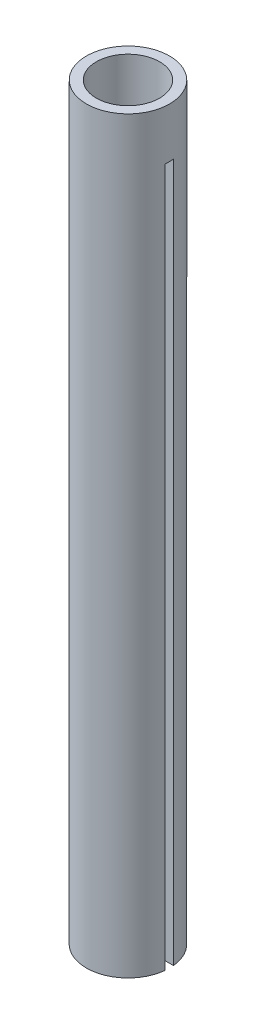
ISO-10303-21;
HEADER;
FILE_DESCRIPTION(('STEP AP214'),'2;1');
FILE_NAME('part.step','',(''),(''),'','','');
FILE_SCHEMA(('AUTOMOTIVE_DESIGN { 1 0 10303 214 1 1 1 1 }'));
ENDSEC;
DATA;
#1=APPLICATION_CONTEXT('core data for automotive mechanical design processes');
#2=APPLICATION_PROTOCOL_DEFINITION('international standard','automotive_design',2000,#1);
#3=PRODUCT_CONTEXT('',#1,'mechanical');
#4=PRODUCT('Part','Part','',(#3));
#5=PRODUCT_RELATED_PRODUCT_CATEGORY('part','',(#4));
#6=PRODUCT_DEFINITION_FORMATION('','',#4);
#7=PRODUCT_DEFINITION_CONTEXT('part definition',#1,'design');
#8=PRODUCT_DEFINITION('design','',#6,#7);
#9=PRODUCT_DEFINITION_SHAPE('','',#8);
#10=(LENGTH_UNIT() NAMED_UNIT(*) SI_UNIT(.MILLI.,.METRE.));
#11=(NAMED_UNIT(*) PLANE_ANGLE_UNIT() SI_UNIT($,.RADIAN.));
#12=(NAMED_UNIT(*) SI_UNIT($,.STERADIAN.) SOLID_ANGLE_UNIT());
#13=UNCERTAINTY_MEASURE_WITH_UNIT(LENGTH_MEASURE(1.E-05),#10,'distance_accuracy_value','');
#14=(GEOMETRIC_REPRESENTATION_CONTEXT(3) GLOBAL_UNCERTAINTY_ASSIGNED_CONTEXT((#13)) GLOBAL_UNIT_ASSIGNED_CONTEXT((#10,
#11,#12)) REPRESENTATION_CONTEXT('',''));
#15=CARTESIAN_POINT('',(0.,0.,0.));
#16=DIRECTION('',(0.,0.,1.));
#17=DIRECTION('',(1.,0.,0.));
#18=AXIS2_PLACEMENT_3D('',#15,#16,#17);
#19=CARTESIAN_POINT('',(0.,-225.,0.));
#20=DIRECTION('',(0.,1.,0.));
#21=DIRECTION('',(0.,0.,1.));
#22=AXIS2_PLACEMENT_3D('',#19,#20,#21);
#23=CYLINDRICAL_SURFACE('',#22,12.5);
#24=CARTESIAN_POINT('',(0.,0.,0.));
#25=DIRECTION('',(0.,1.,0.));
#26=DIRECTION('',(0.,0.,1.));
#27=AXIS2_PLACEMENT_3D('',#24,#25,#26);
#28=CIRCLE('',#27,12.5);
#29=CARTESIAN_POINT('',(0.,0.,12.5));
#30=VERTEX_POINT('',#29);
#31=EDGE_CURVE('E94',#30,#30,#28,.T.);
#32=ORIENTED_EDGE('',*,*,#31,.F.);
#33=EDGE_LOOP('',(#32));
#34=FACE_BOUND('',#33,.T.);
#35=CARTESIAN_POINT('',(0.,-225.,0.));
#36=DIRECTION('',(0.,1.,0.));
#37=DIRECTION('',(0.,0.,1.));
#38=AXIS2_PLACEMENT_3D('',#35,#36,#37);
#39=CIRCLE('',#38,12.5);
#40=CARTESIAN_POINT('',(12.4373429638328,-225.,-1.24999999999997));
#41=VERTEX_POINT('',#40);
#42=CARTESIAN_POINT('',(12.4373429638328,-225.,1.24999999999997));
#43=VERTEX_POINT('',#42);
#44=EDGE_CURVE('E85',#41,#43,#39,.T.);
#45=ORIENTED_EDGE('',*,*,#44,.T.);
#46=DIRECTION('',(0.,1.,0.));
#47=VECTOR('',#46,1.);
#48=CARTESIAN_POINT('',(12.4373429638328,-225.,1.24999999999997));
#49=LINE('',#48,#47);
#50=CARTESIAN_POINT('',(12.4373429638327,-15.,1.25));
#51=VERTEX_POINT('',#50);
#52=EDGE_CURVE('E80',#43,#51,#49,.T.);
#53=ORIENTED_EDGE('',*,*,#52,.T.);
#54=CARTESIAN_POINT('',(0.,-15.,0.));
#55=DIRECTION('',(0.,-1.,0.));
#56=DIRECTION('',(0.,0.,-1.));
#57=AXIS2_PLACEMENT_3D('',#54,#55,#56);
#58=CIRCLE('',#57,12.5);
#59=CARTESIAN_POINT('',(12.4373429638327,-15.,-1.25));
#60=VERTEX_POINT('',#59);
#61=EDGE_CURVE('E69',#51,#60,#58,.F.);
#62=ORIENTED_EDGE('',*,*,#61,.T.);
#63=DIRECTION('',(0.,1.,0.));
#64=VECTOR('',#63,1.);
#65=CARTESIAN_POINT('',(12.4373429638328,-225.,-1.24999999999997));
#66=LINE('',#65,#64);
#67=EDGE_CURVE('E77',#60,#41,#66,.F.);
#68=ORIENTED_EDGE('',*,*,#67,.T.);
#69=EDGE_LOOP('',(#45,#53,#62,#68));
#70=FACE_BOUND('',#69,.T.);
#71=ADVANCED_FACE('F32',(#34,#70),#23,.T.);
#72=CARTESIAN_POINT('',(0.,-225.,0.));
#73=DIRECTION('',(0.,1.,0.));
#74=DIRECTION('',(0.,0.,1.));
#75=AXIS2_PLACEMENT_3D('',#72,#73,#74);
#76=PLANE('',#75);
#77=DIRECTION('',(-1.,0.,0.));
#78=VECTOR('',#77,1.);
#79=CARTESIAN_POINT('',(12.5,-225.,1.24999999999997));
#80=LINE('',#79,#78);
#81=CARTESIAN_POINT('',(9.41740410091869,-225.,1.24999999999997));
#82=VERTEX_POINT('',#81);
#83=EDGE_CURVE('E52',#43,#82,#80,.T.);
#84=ORIENTED_EDGE('',*,*,#83,.F.);
#85=ORIENTED_EDGE('',*,*,#44,.F.);
#86=DIRECTION('',(-1.,0.,0.));
#87=VECTOR('',#86,1.);
#88=CARTESIAN_POINT('',(12.5,-225.,-1.24999999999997));
#89=LINE('',#88,#87);
#90=CARTESIAN_POINT('',(9.41740410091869,-225.,-1.24999999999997));
#91=VERTEX_POINT('',#90);
#92=EDGE_CURVE('E104',#41,#91,#89,.T.);
#93=ORIENTED_EDGE('',*,*,#92,.T.);
#94=CARTESIAN_POINT('',(0.,-225.,0.));
#95=DIRECTION('',(0.,1.,0.));
#96=DIRECTION('',(0.,0.,1.));
#97=AXIS2_PLACEMENT_3D('',#94,#95,#96);
#98=CIRCLE('',#97,9.5);
#99=EDGE_CURVE('E89',#91,#82,#98,.T.);
#100=ORIENTED_EDGE('',*,*,#99,.T.);
#101=EDGE_LOOP('',(#84,#85,#93,#100));
#102=FACE_BOUND('',#101,.T.);
#103=ADVANCED_FACE('F108',(#102),#76,.F.);
#104=CARTESIAN_POINT('',(0.,-225.,0.));
#105=DIRECTION('',(0.,1.,0.));
#106=DIRECTION('',(0.,0.,1.));
#107=AXIS2_PLACEMENT_3D('',#104,#105,#106);
#108=CYLINDRICAL_SURFACE('',#107,9.5);
#109=CARTESIAN_POINT('',(0.,0.,0.));
#110=DIRECTION('',(0.,1.,0.));
#111=DIRECTION('',(0.,0.,1.));
#112=AXIS2_PLACEMENT_3D('',#109,#110,#111);
#113=CIRCLE('',#112,9.5);
#114=CARTESIAN_POINT('',(0.,0.,9.5));
#115=VERTEX_POINT('',#114);
#116=EDGE_CURVE('E86',#115,#115,#113,.T.);
#117=ORIENTED_EDGE('',*,*,#116,.T.);
#118=EDGE_LOOP('',(#117));
#119=FACE_BOUND('',#118,.T.);
#120=DIRECTION('',(0.,1.,0.));
#121=VECTOR('',#120,1.);
#122=CARTESIAN_POINT('',(9.41740410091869,-225.,1.24999999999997));
#123=LINE('',#122,#121);
#124=CARTESIAN_POINT('',(9.41740410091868,-15.,1.25));
#125=VERTEX_POINT('',#124);
#126=EDGE_CURVE('E11',#82,#125,#123,.T.);
#127=ORIENTED_EDGE('',*,*,#126,.F.);
#128=ORIENTED_EDGE('',*,*,#99,.F.);
#129=DIRECTION('',(0.,1.,0.));
#130=VECTOR('',#129,1.);
#131=CARTESIAN_POINT('',(9.41740410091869,-225.,-1.24999999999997));
#132=LINE('',#131,#130);
#133=CARTESIAN_POINT('',(9.41740410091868,-15.,-1.25));
#134=VERTEX_POINT('',#133);
#135=EDGE_CURVE('E39',#134,#91,#132,.F.);
#136=ORIENTED_EDGE('',*,*,#135,.F.);
#137=CARTESIAN_POINT('',(0.,-15.,0.));
#138=DIRECTION('',(0.,-1.,0.));
#139=DIRECTION('',(0.,0.,-1.));
#140=AXIS2_PLACEMENT_3D('',#137,#138,#139);
#141=CIRCLE('',#140,9.5);
#142=EDGE_CURVE('E97',#125,#134,#141,.F.);
#143=ORIENTED_EDGE('',*,*,#142,.F.);
#144=EDGE_LOOP('',(#127,#128,#136,#143));
#145=FACE_BOUND('',#144,.T.);
#146=ADVANCED_FACE('F110',(#119,#145),#108,.F.);
#147=CARTESIAN_POINT('',(0.,0.,0.));
#148=DIRECTION('',(0.,1.,0.));
#149=DIRECTION('',(0.,0.,1.));
#150=AXIS2_PLACEMENT_3D('',#147,#148,#149);
#151=PLANE('',#150);
#152=ORIENTED_EDGE('',*,*,#116,.F.);
#153=EDGE_LOOP('',(#152));
#154=FACE_BOUND('',#153,.T.);
#155=ORIENTED_EDGE('',*,*,#31,.T.);
#156=EDGE_LOOP('',(#155));
#157=FACE_BOUND('',#156,.T.);
#158=ADVANCED_FACE('F112',(#154,#157),#151,.T.);
#159=CARTESIAN_POINT('',(12.5,-15.,1.25));
#160=DIRECTION('',(0.,0.,-1.));
#161=DIRECTION('',(0.,1.,0.));
#162=AXIS2_PLACEMENT_3D('',#159,#160,#161);
#163=PLANE('',#162);
#164=ORIENTED_EDGE('',*,*,#83,.T.);
#165=ORIENTED_EDGE('',*,*,#126,.T.);
#166=DIRECTION('',(-1.,0.,0.));
#167=VECTOR('',#166,1.);
#168=CARTESIAN_POINT('',(12.5,-15.,1.25));
#169=LINE('',#168,#167);
#170=EDGE_CURVE('E46',#51,#125,#169,.T.);
#171=ORIENTED_EDGE('',*,*,#170,.F.);
#172=ORIENTED_EDGE('',*,*,#52,.F.);
#173=EDGE_LOOP('',(#164,#165,#171,#172));
#174=FACE_BOUND('',#173,.T.);
#175=ADVANCED_FACE('F79',(#174),#163,.T.);
#176=CARTESIAN_POINT('',(12.5,-15.,-1.25));
#177=DIRECTION('',(0.,0.,1.));
#178=DIRECTION('',(0.,-1.,0.));
#179=AXIS2_PLACEMENT_3D('',#176,#177,#178);
#180=PLANE('',#179);
#181=DIRECTION('',(-1.,0.,0.));
#182=VECTOR('',#181,1.);
#183=CARTESIAN_POINT('',(12.5,-15.,-1.25));
#184=LINE('',#183,#182);
#185=EDGE_CURVE('E72',#60,#134,#184,.T.);
#186=ORIENTED_EDGE('',*,*,#185,.T.);
#187=ORIENTED_EDGE('',*,*,#135,.T.);
#188=ORIENTED_EDGE('',*,*,#92,.F.);
#189=ORIENTED_EDGE('',*,*,#67,.F.);
#190=EDGE_LOOP('',(#186,#187,#188,#189));
#191=FACE_BOUND('',#190,.T.);
#192=ADVANCED_FACE('F103',(#191),#180,.T.);
#193=CARTESIAN_POINT('',(12.5,-15.,1.25));
#194=DIRECTION('',(0.,-1.,0.));
#195=DIRECTION('',(0.,0.,-1.));
#196=AXIS2_PLACEMENT_3D('',#193,#194,#195);
#197=PLANE('',#196);
#198=ORIENTED_EDGE('',*,*,#170,.T.);
#199=ORIENTED_EDGE('',*,*,#142,.T.);
#200=ORIENTED_EDGE('',*,*,#185,.F.);
#201=ORIENTED_EDGE('',*,*,#61,.F.);
#202=EDGE_LOOP('',(#198,#199,#200,#201));
#203=FACE_BOUND('',#202,.T.);
#204=ADVANCED_FACE('F70',(#203),#197,.T.);
#205=CLOSED_SHELL('',(#71,#103,#146,#158,#175,#192,#204));
#206=MANIFOLD_SOLID_BREP('B2',#205);
#207=ADVANCED_BREP_SHAPE_REPRESENTATION('',(#18,#206),#14);
#208=SHAPE_DEFINITION_REPRESENTATION(#9,#207);
ENDSEC;
END-ISO-10303-21;
